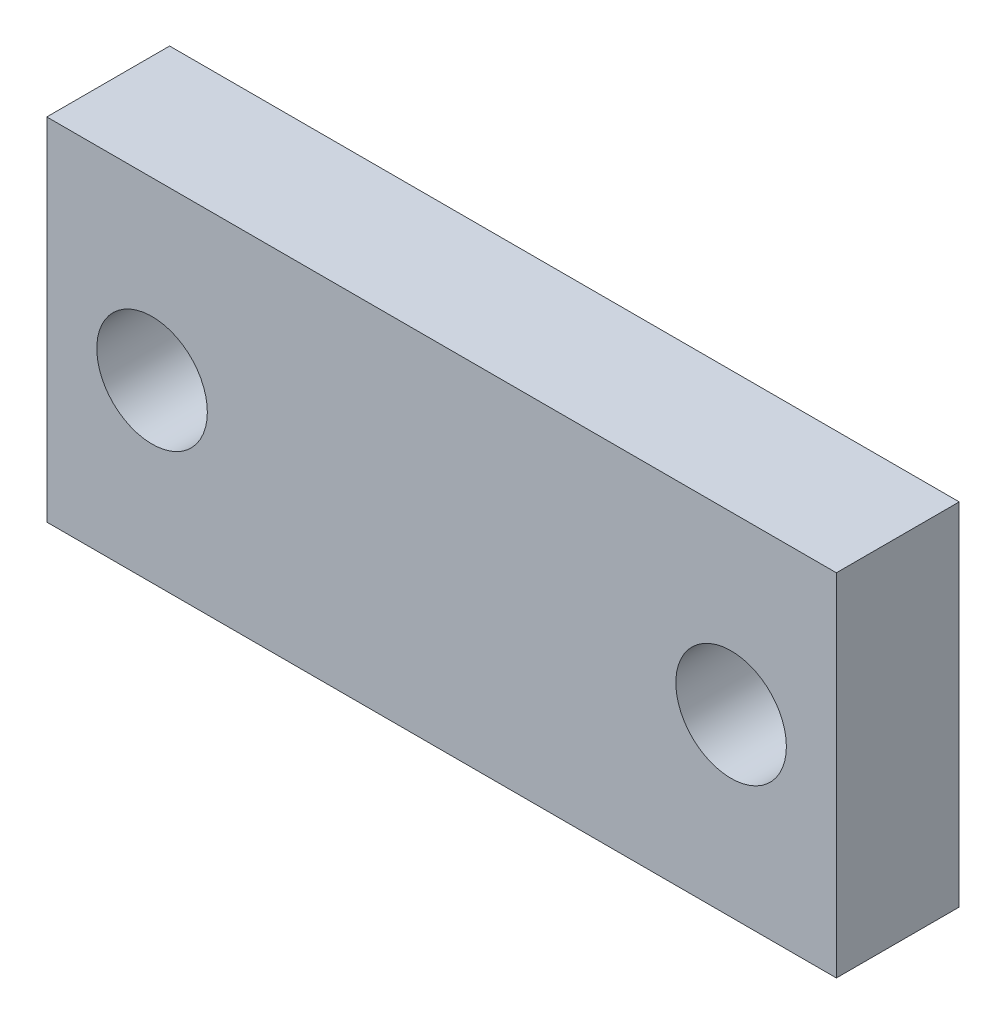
from build123d import *

# Parameters (mm, degrees)
ESQUISSE1_W             = 45
ESQUISSE1_H             = 20
BOSS_EXTRU_1_DEPTH      = 7
ESQUISSE2_R             = 3.15
ENL_V_MAT_EXTRU_1_DEPTH = 7


with BuildPart() as part:
    # Esquisse1 → Boss.-Extru.1 (new body)
    with BuildSketch(Plane.XY):
        with Locations((22.5, -10)):
            Rectangle(ESQUISSE1_W, ESQUISSE1_H)
    extrude(amount=BOSS_EXTRU_1_DEPTH)

    # Esquisse2 → Enl_v. mat.-Extru.1 (cut)
    with BuildSketch(Plane.XY.offset(7)):
        with Locations((6, -10)):
            Circle(ESQUISSE2_R)
        with Locations((39, -10)):
            Circle(ESQUISSE2_R)
    extrude(amount=-ENL_V_MAT_EXTRU_1_DEPTH, mode=Mode.SUBTRACT)


solid = part.part
